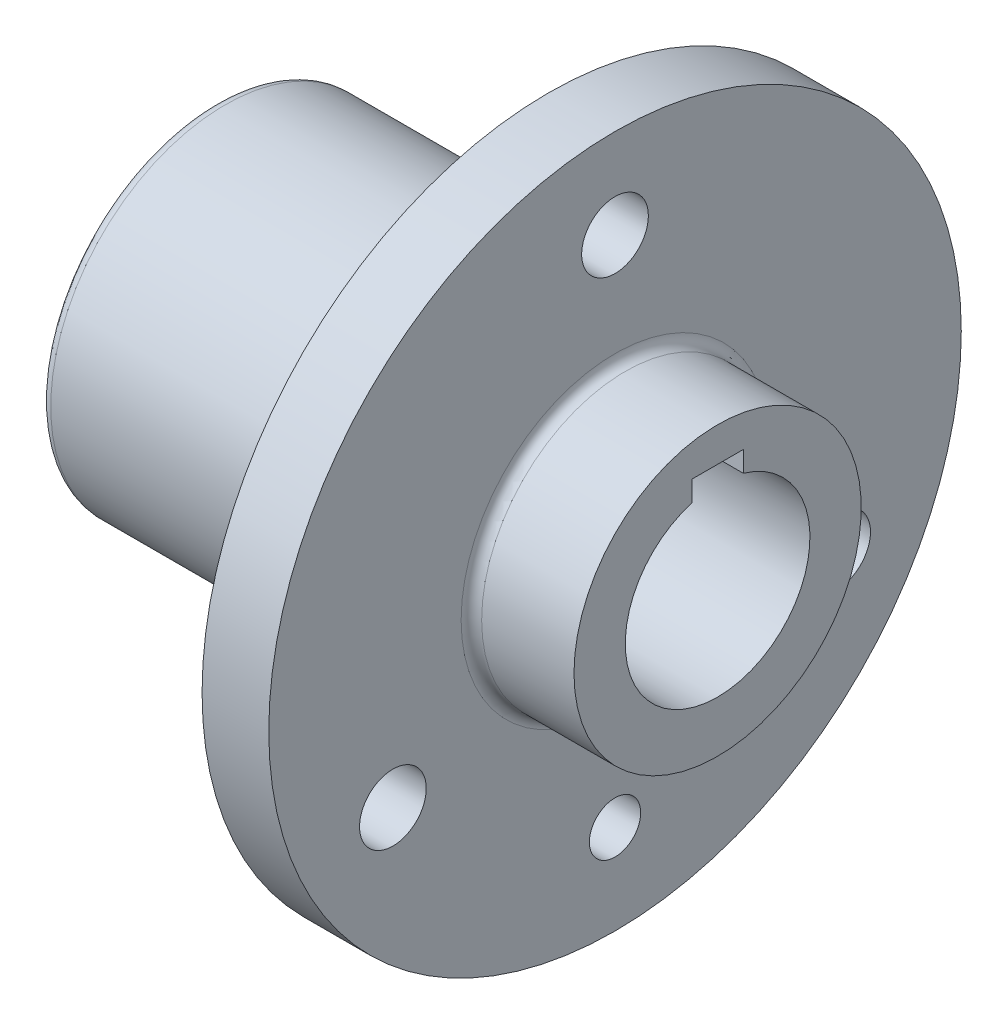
ISO-10303-21;
HEADER;
FILE_DESCRIPTION(('STEP AP214'),'2;1');
FILE_NAME('part.step','',(''),(''),'','','');
FILE_SCHEMA(('AUTOMOTIVE_DESIGN { 1 0 10303 214 1 1 1 1 }'));
ENDSEC;
DATA;
#1=APPLICATION_CONTEXT('core data for automotive mechanical design processes');
#2=APPLICATION_PROTOCOL_DEFINITION('international standard','automotive_design',2000,#1);
#3=PRODUCT_CONTEXT('',#1,'mechanical');
#4=PRODUCT('Part','Part','',(#3));
#5=PRODUCT_RELATED_PRODUCT_CATEGORY('part','',(#4));
#6=PRODUCT_DEFINITION_FORMATION('','',#4);
#7=PRODUCT_DEFINITION_CONTEXT('part definition',#1,'design');
#8=PRODUCT_DEFINITION('design','',#6,#7);
#9=PRODUCT_DEFINITION_SHAPE('','',#8);
#10=(LENGTH_UNIT() NAMED_UNIT(*) SI_UNIT(.MILLI.,.METRE.));
#11=(NAMED_UNIT(*) PLANE_ANGLE_UNIT() SI_UNIT($,.RADIAN.));
#12=(NAMED_UNIT(*) SI_UNIT($,.STERADIAN.) SOLID_ANGLE_UNIT());
#13=UNCERTAINTY_MEASURE_WITH_UNIT(LENGTH_MEASURE(1.E-05),#10,'distance_accuracy_value','');
#14=(GEOMETRIC_REPRESENTATION_CONTEXT(3) GLOBAL_UNCERTAINTY_ASSIGNED_CONTEXT((#13)) GLOBAL_UNIT_ASSIGNED_CONTEXT((#10,
#11,#12)) REPRESENTATION_CONTEXT('',''));
#15=CARTESIAN_POINT('',(0.,0.,0.));
#16=DIRECTION('',(0.,0.,1.));
#17=DIRECTION('',(1.,0.,0.));
#18=AXIS2_PLACEMENT_3D('',#15,#16,#17);
#19=CARTESIAN_POINT('',(-48.7465831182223,-10.,0.));
#20=DIRECTION('',(-1.,0.,0.));
#21=DIRECTION('',(0.,0.,1.));
#22=AXIS2_PLACEMENT_3D('',#19,#20,#21);
#23=CYLINDRICAL_SURFACE('',#22,10.);
#24=CARTESIAN_POINT('',(-36.7465831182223,-10.,0.));
#25=DIRECTION('',(-1.,0.,0.));
#26=DIRECTION('',(0.,0.,1.));
#27=AXIS2_PLACEMENT_3D('',#24,#25,#26);
#28=CIRCLE('',#27,10.);
#29=CARTESIAN_POINT('',(-36.7465831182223,-10.,10.));
#30=VERTEX_POINT('',#29);
#31=EDGE_CURVE('E171',#30,#30,#28,.T.);
#32=ORIENTED_EDGE('',*,*,#31,.F.);
#33=EDGE_LOOP('',(#32));
#34=FACE_BOUND('',#33,.T.);
#35=CARTESIAN_POINT('',(-48.7465831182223,-10.,0.));
#36=DIRECTION('',(-1.,0.,0.));
#37=DIRECTION('',(0.,0.,1.));
#38=AXIS2_PLACEMENT_3D('',#35,#36,#37);
#39=CIRCLE('',#38,10.);
#40=CARTESIAN_POINT('',(-48.7465831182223,-10.,10.));
#41=VERTEX_POINT('',#40);
#42=EDGE_CURVE('E139',#41,#41,#39,.T.);
#43=ORIENTED_EDGE('',*,*,#42,.T.);
#44=EDGE_LOOP('',(#43));
#45=FACE_BOUND('',#44,.T.);
#46=ADVANCED_FACE('F43',(#34,#45),#23,.F.);
#47=CARTESIAN_POINT('',(-36.7465831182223,-10.,0.));
#48=DIRECTION('',(1.,0.,0.));
#49=DIRECTION('',(0.,0.,-1.));
#50=AXIS2_PLACEMENT_3D('',#47,#48,#49);
#51=CONICAL_SURFACE('',#50,10.,0.78539816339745);
#52=CARTESIAN_POINT('',(-33.7465831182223,-10.,0.));
#53=DIRECTION('',(-1.,0.,0.));
#54=DIRECTION('',(0.,0.,1.));
#55=AXIS2_PLACEMENT_3D('',#52,#53,#54);
#56=CIRCLE('',#55,13.);
#57=CARTESIAN_POINT('',(-33.7465831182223,-10.,13.));
#58=VERTEX_POINT('',#57);
#59=EDGE_CURVE('E167',#58,#58,#56,.T.);
#60=ORIENTED_EDGE('',*,*,#59,.F.);
#61=EDGE_LOOP('',(#60));
#62=FACE_BOUND('',#61,.T.);
#63=ORIENTED_EDGE('',*,*,#31,.T.);
#64=EDGE_LOOP('',(#63));
#65=FACE_BOUND('',#64,.T.);
#66=ADVANCED_FACE('F295',(#62,#65),#51,.F.);
#67=CARTESIAN_POINT('',(-33.7465831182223,3.00000000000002,0.));
#68=DIRECTION('',(-1.,0.,0.));
#69=DIRECTION('',(0.,0.,1.));
#70=AXIS2_PLACEMENT_3D('',#67,#68,#69);
#71=PLANE('',#70);
#72=CARTESIAN_POINT('',(-33.7465831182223,-10.,0.));
#73=DIRECTION('',(-1.,0.,0.));
#74=DIRECTION('',(0.,0.,1.));
#75=AXIS2_PLACEMENT_3D('',#72,#73,#74);
#76=CIRCLE('',#75,22.);
#77=CARTESIAN_POINT('',(-33.7465831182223,-10.,22.));
#78=VERTEX_POINT('',#77);
#79=EDGE_CURVE('E217',#78,#78,#76,.F.);
#80=ORIENTED_EDGE('',*,*,#79,.T.);
#81=EDGE_LOOP('',(#80));
#82=FACE_BOUND('',#81,.T.);
#83=ORIENTED_EDGE('',*,*,#59,.T.);
#84=EDGE_LOOP('',(#83));
#85=FACE_BOUND('',#84,.T.);
#86=ADVANCED_FACE('F291',(#82,#85),#71,.F.);
#87=CARTESIAN_POINT('',(-48.7465831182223,-10.,0.));
#88=DIRECTION('',(-1.,0.,0.));
#89=DIRECTION('',(0.,0.,1.));
#90=AXIS2_PLACEMENT_3D('',#87,#88,#89);
#91=CYLINDRICAL_SURFACE('',#90,24.);
#92=CARTESIAN_POINT('',(-31.7465831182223,-10.,0.));
#93=DIRECTION('',(-1.,0.,0.));
#94=DIRECTION('',(0.,0.,1.));
#95=AXIS2_PLACEMENT_3D('',#92,#93,#94);
#96=CIRCLE('',#95,24.);
#97=CARTESIAN_POINT('',(-31.7465831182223,-10.,24.));
#98=VERTEX_POINT('',#97);
#99=EDGE_CURVE('E213',#98,#98,#96,.T.);
#100=ORIENTED_EDGE('',*,*,#99,.T.);
#101=EDGE_LOOP('',(#100));
#102=FACE_BOUND('',#101,.T.);
#103=CARTESIAN_POINT('',(2.25341688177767,-10.,0.));
#104=DIRECTION('',(-1.,0.,0.));
#105=DIRECTION('',(0.,0.,1.));
#106=AXIS2_PLACEMENT_3D('',#103,#104,#105);
#107=CIRCLE('',#106,24.);
#108=CARTESIAN_POINT('',(2.25341688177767,-10.,24.));
#109=VERTEX_POINT('',#108);
#110=EDGE_CURVE('E163',#109,#109,#107,.T.);
#111=ORIENTED_EDGE('',*,*,#110,.F.);
#112=EDGE_LOOP('',(#111));
#113=FACE_BOUND('',#112,.T.);
#114=ADVANCED_FACE('F288',(#102,#113),#91,.F.);
#115=CARTESIAN_POINT('',(2.25341688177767,14.,0.));
#116=DIRECTION('',(1.,0.,0.));
#117=DIRECTION('',(0.,0.,-1.));
#118=AXIS2_PLACEMENT_3D('',#115,#116,#117);
#119=PLANE('',#118);
#120=CARTESIAN_POINT('',(2.25341688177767,-10.,0.));
#121=DIRECTION('',(1.,0.,0.));
#122=DIRECTION('',(0.,0.,-1.));
#123=AXIS2_PLACEMENT_3D('',#120,#121,#122);
#124=CIRCLE('',#123,20.);
#125=CARTESIAN_POINT('',(2.25341688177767,9.36491673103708,5.));
#126=VERTEX_POINT('',#125);
#127=CARTESIAN_POINT('',(2.25341688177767,9.36491673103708,-5.));
#128=VERTEX_POINT('',#127);
#129=EDGE_CURVE('E115',#126,#128,#124,.T.);
#130=ORIENTED_EDGE('',*,*,#129,.T.);
#131=DIRECTION('',(0.,1.,0.));
#132=VECTOR('',#131,1.);
#133=CARTESIAN_POINT('',(2.25341688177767,4.70000000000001,-5.));
#134=LINE('',#133,#132);
#135=CARTESIAN_POINT('',(2.25341688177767,11.3,-5.));
#136=VERTEX_POINT('',#135);
#137=EDGE_CURVE('E93',#128,#136,#134,.T.);
#138=ORIENTED_EDGE('',*,*,#137,.T.);
#139=DIRECTION('',(0.,0.,1.));
#140=VECTOR('',#139,1.);
#141=CARTESIAN_POINT('',(2.25341688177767,11.3,5.));
#142=LINE('',#141,#140);
#143=CARTESIAN_POINT('',(2.25341688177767,11.3,5.));
#144=VERTEX_POINT('',#143);
#145=EDGE_CURVE('E104',#136,#144,#142,.T.);
#146=ORIENTED_EDGE('',*,*,#145,.T.);
#147=DIRECTION('',(0.,-1.,0.));
#148=VECTOR('',#147,1.);
#149=CARTESIAN_POINT('',(2.25341688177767,4.70000000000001,5.));
#150=LINE('',#149,#148);
#151=EDGE_CURVE('E101',#144,#126,#150,.T.);
#152=ORIENTED_EDGE('',*,*,#151,.T.);
#153=EDGE_LOOP('',(#130,#138,#146,#152));
#154=FACE_BOUND('',#153,.T.);
#155=ORIENTED_EDGE('',*,*,#110,.T.);
#156=EDGE_LOOP('',(#155));
#157=FACE_BOUND('',#156,.T.);
#158=ADVANCED_FACE('F112',(#154,#157),#119,.F.);
#159=CARTESIAN_POINT('',(-48.7465831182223,-10.,0.));
#160=DIRECTION('',(-1.,0.,0.));
#161=DIRECTION('',(0.,0.,1.));
#162=AXIS2_PLACEMENT_3D('',#159,#160,#161);
#163=CYLINDRICAL_SURFACE('',#162,18.);
#164=CARTESIAN_POINT('',(54.2534168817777,-10.,0.));
#165=DIRECTION('',(-1.,0.,0.));
#166=DIRECTION('',(0.,0.,1.));
#167=AXIS2_PLACEMENT_3D('',#164,#165,#166);
#168=CIRCLE('',#167,18.);
#169=CARTESIAN_POINT('',(54.2534168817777,7.29161646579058,-5.));
#170=VERTEX_POINT('',#169);
#171=CARTESIAN_POINT('',(54.2534168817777,7.29161646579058,5.));
#172=VERTEX_POINT('',#171);
#173=EDGE_CURVE('E159',#170,#172,#168,.T.);
#174=ORIENTED_EDGE('',*,*,#173,.F.);
#175=DIRECTION('',(-1.,0.,0.));
#176=VECTOR('',#175,1.);
#177=CARTESIAN_POINT('',(-48.7465831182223,7.29161646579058,-5.));
#178=LINE('',#177,#176);
#179=CARTESIAN_POINT('',(4.25341688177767,7.29161646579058,-5.));
#180=VERTEX_POINT('',#179);
#181=EDGE_CURVE('E136',#170,#180,#178,.T.);
#182=ORIENTED_EDGE('',*,*,#181,.T.);
#183=CARTESIAN_POINT('',(4.25341688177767,-10.,0.));
#184=DIRECTION('',(1.,0.,0.));
#185=DIRECTION('',(0.,0.,-1.));
#186=AXIS2_PLACEMENT_3D('',#183,#184,#185);
#187=CIRCLE('',#186,18.);
#188=CARTESIAN_POINT('',(4.25341688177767,7.29161646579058,5.));
#189=VERTEX_POINT('',#188);
#190=EDGE_CURVE('E207',#180,#189,#187,.F.);
#191=ORIENTED_EDGE('',*,*,#190,.T.);
#192=DIRECTION('',(-1.,0.,0.));
#193=VECTOR('',#192,1.);
#194=CARTESIAN_POINT('',(-48.7465831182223,7.29161646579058,5.));
#195=LINE('',#194,#193);
#196=EDGE_CURVE('E61',#189,#172,#195,.F.);
#197=ORIENTED_EDGE('',*,*,#196,.T.);
#198=EDGE_LOOP('',(#174,#182,#191,#197));
#199=FACE_BOUND('',#198,.T.);
#200=ADVANCED_FACE('F281',(#199),#163,.F.);
#201=CARTESIAN_POINT('',(54.2534168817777,8.,0.));
#202=DIRECTION('',(-1.,0.,0.));
#203=DIRECTION('',(0.,0.,1.));
#204=AXIS2_PLACEMENT_3D('',#201,#202,#203);
#205=PLANE('',#204);
#206=CARTESIAN_POINT('',(54.2534168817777,-10.,0.));
#207=DIRECTION('',(-1.,0.,0.));
#208=DIRECTION('',(0.,0.,1.));
#209=AXIS2_PLACEMENT_3D('',#206,#207,#208);
#210=CIRCLE('',#209,28.);
#211=CARTESIAN_POINT('',(54.2534168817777,-10.,28.));
#212=VERTEX_POINT('',#211);
#213=EDGE_CURVE('E155',#212,#212,#210,.T.);
#214=ORIENTED_EDGE('',*,*,#213,.F.);
#215=EDGE_LOOP('',(#214));
#216=FACE_BOUND('',#215,.T.);
#217=DIRECTION('',(0.,0.,1.));
#218=VECTOR('',#217,1.);
#219=CARTESIAN_POINT('',(54.2534168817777,11.3,5.));
#220=LINE('',#219,#218);
#221=CARTESIAN_POINT('',(54.2534168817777,11.3,-5.));
#222=VERTEX_POINT('',#221);
#223=CARTESIAN_POINT('',(54.2534168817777,11.3,5.));
#224=VERTEX_POINT('',#223);
#225=EDGE_CURVE('E120',#222,#224,#220,.T.);
#226=ORIENTED_EDGE('',*,*,#225,.F.);
#227=DIRECTION('',(0.,1.,0.));
#228=VECTOR('',#227,1.);
#229=CARTESIAN_POINT('',(54.2534168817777,4.70000000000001,-5.));
#230=LINE('',#229,#228);
#231=EDGE_CURVE('E95',#170,#222,#230,.T.);
#232=ORIENTED_EDGE('',*,*,#231,.F.);
#233=ORIENTED_EDGE('',*,*,#173,.T.);
#234=DIRECTION('',(0.,-1.,0.));
#235=VECTOR('',#234,1.);
#236=CARTESIAN_POINT('',(54.2534168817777,4.70000000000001,5.));
#237=LINE('',#236,#235);
#238=EDGE_CURVE('E117',#224,#172,#237,.T.);
#239=ORIENTED_EDGE('',*,*,#238,.F.);
#240=EDGE_LOOP('',(#226,#232,#233,#239));
#241=FACE_BOUND('',#240,.T.);
#242=ADVANCED_FACE('F277',(#216,#241),#205,.F.);
#243=CARTESIAN_POINT('',(-48.7465831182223,-10.,0.));
#244=DIRECTION('',(-1.,0.,0.));
#245=DIRECTION('',(0.,0.,1.));
#246=AXIS2_PLACEMENT_3D('',#243,#244,#245);
#247=CYLINDRICAL_SURFACE('',#246,28.);
#248=CARTESIAN_POINT('',(36.2534168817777,-10.,0.));
#249=DIRECTION('',(-1.,0.,0.));
#250=DIRECTION('',(0.,0.,1.));
#251=AXIS2_PLACEMENT_3D('',#248,#249,#250);
#252=CIRCLE('',#251,28.);
#253=CARTESIAN_POINT('',(36.2534168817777,-10.,28.));
#254=VERTEX_POINT('',#253);
#255=EDGE_CURVE('E195',#254,#254,#252,.F.);
#256=ORIENTED_EDGE('',*,*,#255,.T.);
#257=EDGE_LOOP('',(#256));
#258=FACE_BOUND('',#257,.T.);
#259=ORIENTED_EDGE('',*,*,#213,.T.);
#260=EDGE_LOOP('',(#259));
#261=FACE_BOUND('',#260,.T.);
#262=ADVANCED_FACE('F273',(#258,#261),#247,.T.);
#263=CARTESIAN_POINT('',(34.2534168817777,57.5,0.));
#264=DIRECTION('',(-1.,0.,0.));
#265=DIRECTION('',(0.,0.,1.));
#266=AXIS2_PLACEMENT_3D('',#263,#264,#265);
#267=PLANE('',#266);
#268=CARTESIAN_POINT('',(34.2534168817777,40.,0.));
#269=DIRECTION('',(1.,0.,0.));
#270=DIRECTION('',(0.,0.,-1.));
#271=AXIS2_PLACEMENT_3D('',#268,#269,#270);
#272=CIRCLE('',#271,6.5);
#273=CARTESIAN_POINT('',(34.2534168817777,40.,-6.5));
#274=VERTEX_POINT('',#273);
#275=EDGE_CURVE('E582',#274,#274,#272,.T.);
#276=ORIENTED_EDGE('',*,*,#275,.F.);
#277=EDGE_LOOP('',(#276));
#278=FACE_BOUND('',#277,.T.);
#279=CARTESIAN_POINT('',(34.2534168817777,-60.,0.));
#280=DIRECTION('',(1.,0.,0.));
#281=DIRECTION('',(0.,0.,-1.));
#282=AXIS2_PLACEMENT_3D('',#279,#280,#281);
#283=CIRCLE('',#282,5.);
#284=CARTESIAN_POINT('',(34.2534168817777,-60.,-5.));
#285=VERTEX_POINT('',#284);
#286=EDGE_CURVE('E601',#285,#285,#283,.T.);
#287=ORIENTED_EDGE('',*,*,#286,.F.);
#288=EDGE_LOOP('',(#287));
#289=FACE_BOUND('',#288,.T.);
#290=CARTESIAN_POINT('',(34.2534168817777,-34.9999999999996,-43.3012701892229));
#291=DIRECTION('',(1.,0.,0.));
#292=DIRECTION('',(0.,0.,-1.));
#293=AXIS2_PLACEMENT_3D('',#290,#291,#292);
#294=CIRCLE('',#293,6.50000000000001);
#295=CARTESIAN_POINT('',(34.2534168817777,-34.9999999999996,-49.8012701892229));
#296=VERTEX_POINT('',#295);
#297=EDGE_CURVE('E605',#296,#296,#294,.T.);
#298=ORIENTED_EDGE('',*,*,#297,.F.);
#299=EDGE_LOOP('',(#298));
#300=FACE_BOUND('',#299,.T.);
#301=CARTESIAN_POINT('',(34.2534168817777,-35.0000000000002,43.3012701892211));
#302=DIRECTION('',(1.,0.,0.));
#303=DIRECTION('',(0.,0.,-1.));
#304=AXIS2_PLACEMENT_3D('',#301,#302,#303);
#305=CIRCLE('',#304,6.5);
#306=CARTESIAN_POINT('',(34.2534168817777,-35.0000000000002,36.8012701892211));
#307=VERTEX_POINT('',#306);
#308=EDGE_CURVE('E123',#307,#307,#305,.T.);
#309=ORIENTED_EDGE('',*,*,#308,.F.);
#310=EDGE_LOOP('',(#309));
#311=FACE_BOUND('',#310,.T.);
#312=CARTESIAN_POINT('',(34.2534168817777,-10.,0.));
#313=DIRECTION('',(-1.,0.,0.));
#314=DIRECTION('',(0.,0.,1.));
#315=AXIS2_PLACEMENT_3D('',#312,#313,#314);
#316=CIRCLE('',#315,30.);
#317=CARTESIAN_POINT('',(34.2534168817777,-10.,30.));
#318=VERTEX_POINT('',#317);
#319=EDGE_CURVE('E191',#318,#318,#316,.T.);
#320=ORIENTED_EDGE('',*,*,#319,.T.);
#321=EDGE_LOOP('',(#320));
#322=FACE_BOUND('',#321,.T.);
#323=CARTESIAN_POINT('',(34.2534168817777,-10.,0.));
#324=DIRECTION('',(-1.,0.,0.));
#325=DIRECTION('',(0.,0.,1.));
#326=AXIS2_PLACEMENT_3D('',#323,#324,#325);
#327=CIRCLE('',#326,67.5);
#328=CARTESIAN_POINT('',(34.2534168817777,-10.,67.5));
#329=VERTEX_POINT('',#328);
#330=EDGE_CURVE('E151',#329,#329,#327,.T.);
#331=ORIENTED_EDGE('',*,*,#330,.F.);
#332=EDGE_LOOP('',(#331));
#333=FACE_BOUND('',#332,.T.);
#334=ADVANCED_FACE('F269',(#278,#289,#300,#311,#322,#333),#267,.F.);
#335=CARTESIAN_POINT('',(-48.7465831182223,-10.,0.));
#336=DIRECTION('',(-1.,0.,0.));
#337=DIRECTION('',(0.,0.,1.));
#338=AXIS2_PLACEMENT_3D('',#335,#336,#337);
#339=CYLINDRICAL_SURFACE('',#338,67.5);
#340=CARTESIAN_POINT('',(21.2534168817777,-10.,0.));
#341=DIRECTION('',(-1.,0.,0.));
#342=DIRECTION('',(0.,0.,1.));
#343=AXIS2_PLACEMENT_3D('',#340,#341,#342);
#344=CIRCLE('',#343,67.5);
#345=CARTESIAN_POINT('',(21.2534168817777,-10.,67.5));
#346=VERTEX_POINT('',#345);
#347=EDGE_CURVE('E147',#346,#346,#344,.T.);
#348=ORIENTED_EDGE('',*,*,#347,.F.);
#349=EDGE_LOOP('',(#348));
#350=FACE_BOUND('',#349,.T.);
#351=ORIENTED_EDGE('',*,*,#330,.T.);
#352=EDGE_LOOP('',(#351));
#353=FACE_BOUND('',#352,.T.);
#354=ADVANCED_FACE('F265',(#350,#353),#339,.T.);
#355=CARTESIAN_POINT('',(21.2534168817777,24.,0.));
#356=DIRECTION('',(1.,0.,0.));
#357=DIRECTION('',(0.,0.,-1.));
#358=AXIS2_PLACEMENT_3D('',#355,#356,#357);
#359=PLANE('',#358);
#360=CARTESIAN_POINT('',(21.2534168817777,40.,0.));
#361=DIRECTION('',(1.,0.,0.));
#362=DIRECTION('',(0.,0.,-1.));
#363=AXIS2_PLACEMENT_3D('',#360,#361,#362);
#364=CIRCLE('',#363,6.5);
#365=CARTESIAN_POINT('',(21.2534168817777,40.,-6.5));
#366=VERTEX_POINT('',#365);
#367=EDGE_CURVE('E47',#366,#366,#364,.T.);
#368=ORIENTED_EDGE('',*,*,#367,.T.);
#369=EDGE_LOOP('',(#368));
#370=FACE_BOUND('',#369,.T.);
#371=CARTESIAN_POINT('',(21.2534168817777,-60.,0.));
#372=DIRECTION('',(1.,0.,0.));
#373=DIRECTION('',(0.,0.,-1.));
#374=AXIS2_PLACEMENT_3D('',#371,#372,#373);
#375=CIRCLE('',#374,5.);
#376=CARTESIAN_POINT('',(21.2534168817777,-60.,-5.));
#377=VERTEX_POINT('',#376);
#378=EDGE_CURVE('E586',#377,#377,#375,.T.);
#379=ORIENTED_EDGE('',*,*,#378,.T.);
#380=EDGE_LOOP('',(#379));
#381=FACE_BOUND('',#380,.T.);
#382=CARTESIAN_POINT('',(21.2534168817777,-34.9999999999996,-43.3012701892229));
#383=DIRECTION('',(1.,0.,0.));
#384=DIRECTION('',(0.,0.,-1.));
#385=AXIS2_PLACEMENT_3D('',#382,#383,#384);
#386=CIRCLE('',#385,6.50000000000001);
#387=CARTESIAN_POINT('',(21.2534168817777,-34.9999999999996,-49.8012701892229));
#388=VERTEX_POINT('',#387);
#389=EDGE_CURVE('E589',#388,#388,#386,.T.);
#390=ORIENTED_EDGE('',*,*,#389,.T.);
#391=EDGE_LOOP('',(#390));
#392=FACE_BOUND('',#391,.T.);
#393=CARTESIAN_POINT('',(21.2534168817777,-35.0000000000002,43.3012701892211));
#394=DIRECTION('',(1.,0.,0.));
#395=DIRECTION('',(0.,0.,-1.));
#396=AXIS2_PLACEMENT_3D('',#393,#394,#395);
#397=CIRCLE('',#396,6.5);
#398=CARTESIAN_POINT('',(21.2534168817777,-35.0000000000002,36.8012701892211));
#399=VERTEX_POINT('',#398);
#400=EDGE_CURVE('E594',#399,#399,#397,.T.);
#401=ORIENTED_EDGE('',*,*,#400,.T.);
#402=EDGE_LOOP('',(#401));
#403=FACE_BOUND('',#402,.T.);
#404=CARTESIAN_POINT('',(21.2534168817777,-10.,0.));
#405=DIRECTION('',(1.,0.,0.));
#406=DIRECTION('',(0.,0.,-1.));
#407=AXIS2_PLACEMENT_3D('',#404,#405,#406);
#408=CIRCLE('',#407,36.);
#409=CARTESIAN_POINT('',(21.2534168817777,-10.,-36.));
#410=VERTEX_POINT('',#409);
#411=EDGE_CURVE('E199',#410,#410,#408,.T.);
#412=ORIENTED_EDGE('',*,*,#411,.T.);
#413=EDGE_LOOP('',(#412));
#414=FACE_BOUND('',#413,.T.);
#415=ORIENTED_EDGE('',*,*,#347,.T.);
#416=EDGE_LOOP('',(#415));
#417=FACE_BOUND('',#416,.T.);
#418=ADVANCED_FACE('F261',(#370,#381,#392,#403,#414,#417),#359,.F.);
#419=CARTESIAN_POINT('',(-48.7465831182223,-10.,0.));
#420=DIRECTION('',(-1.,0.,0.));
#421=DIRECTION('',(0.,0.,1.));
#422=AXIS2_PLACEMENT_3D('',#419,#420,#421);
#423=CYLINDRICAL_SURFACE('',#422,34.);
#424=CARTESIAN_POINT('',(-41.7465831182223,-10.,0.));
#425=DIRECTION('',(1.,0.,0.));
#426=DIRECTION('',(0.,0.,-1.));
#427=AXIS2_PLACEMENT_3D('',#424,#425,#426);
#428=CIRCLE('',#427,34.);
#429=CARTESIAN_POINT('',(-41.7465831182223,-10.,-34.));
#430=VERTEX_POINT('',#429);
#431=EDGE_CURVE('E187',#430,#430,#428,.T.);
#432=ORIENTED_EDGE('',*,*,#431,.T.);
#433=EDGE_LOOP('',(#432));
#434=FACE_BOUND('',#433,.T.);
#435=CARTESIAN_POINT('',(19.2534168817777,-10.,0.));
#436=DIRECTION('',(1.,0.,0.));
#437=DIRECTION('',(0.,0.,-1.));
#438=AXIS2_PLACEMENT_3D('',#435,#436,#437);
#439=CIRCLE('',#438,34.);
#440=CARTESIAN_POINT('',(19.2534168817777,-10.,-34.));
#441=VERTEX_POINT('',#440);
#442=EDGE_CURVE('E183',#441,#441,#439,.F.);
#443=ORIENTED_EDGE('',*,*,#442,.T.);
#444=EDGE_LOOP('',(#443));
#445=FACE_BOUND('',#444,.T.);
#446=ADVANCED_FACE('F257',(#434,#445),#423,.T.);
#447=CARTESIAN_POINT('',(-43.7465831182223,5.,0.));
#448=DIRECTION('',(1.,0.,0.));
#449=DIRECTION('',(0.,0.,-1.));
#450=AXIS2_PLACEMENT_3D('',#447,#448,#449);
#451=PLANE('',#450);
#452=CARTESIAN_POINT('',(-43.7465831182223,-10.,0.));
#453=DIRECTION('',(1.,0.,0.));
#454=DIRECTION('',(0.,0.,-1.));
#455=AXIS2_PLACEMENT_3D('',#452,#453,#454);
#456=CIRCLE('',#455,32.);
#457=CARTESIAN_POINT('',(-43.7465831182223,-10.,-32.));
#458=VERTEX_POINT('',#457);
#459=EDGE_CURVE('E179',#458,#458,#456,.F.);
#460=ORIENTED_EDGE('',*,*,#459,.T.);
#461=EDGE_LOOP('',(#460));
#462=FACE_BOUND('',#461,.T.);
#463=CARTESIAN_POINT('',(-43.7465831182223,-10.,0.));
#464=DIRECTION('',(1.,0.,0.));
#465=DIRECTION('',(0.,0.,-1.));
#466=AXIS2_PLACEMENT_3D('',#463,#464,#465);
#467=CIRCLE('',#466,17.);
#468=CARTESIAN_POINT('',(-43.7465831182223,-10.,-17.));
#469=VERTEX_POINT('',#468);
#470=EDGE_CURVE('E175',#469,#469,#467,.T.);
#471=ORIENTED_EDGE('',*,*,#470,.T.);
#472=EDGE_LOOP('',(#471));
#473=FACE_BOUND('',#472,.T.);
#474=ADVANCED_FACE('F253',(#462,#473),#451,.F.);
#475=CARTESIAN_POINT('',(-48.7465831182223,-10.,0.));
#476=DIRECTION('',(-1.,0.,0.));
#477=DIRECTION('',(0.,0.,1.));
#478=AXIS2_PLACEMENT_3D('',#475,#476,#477);
#479=CYLINDRICAL_SURFACE('',#478,15.);
#480=CARTESIAN_POINT('',(-45.7465831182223,-10.,0.));
#481=DIRECTION('',(1.,0.,0.));
#482=DIRECTION('',(0.,0.,-1.));
#483=AXIS2_PLACEMENT_3D('',#480,#481,#482);
#484=CIRCLE('',#483,15.);
#485=CARTESIAN_POINT('',(-45.7465831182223,-10.,-15.));
#486=VERTEX_POINT('',#485);
#487=EDGE_CURVE('E203',#486,#486,#484,.F.);
#488=ORIENTED_EDGE('',*,*,#487,.T.);
#489=EDGE_LOOP('',(#488));
#490=FACE_BOUND('',#489,.T.);
#491=CARTESIAN_POINT('',(-48.7465831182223,-10.,0.));
#492=DIRECTION('',(-1.,0.,0.));
#493=DIRECTION('',(0.,0.,1.));
#494=AXIS2_PLACEMENT_3D('',#491,#492,#493);
#495=CIRCLE('',#494,15.);
#496=CARTESIAN_POINT('',(-48.7465831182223,-10.,15.));
#497=VERTEX_POINT('',#496);
#498=EDGE_CURVE('E143',#497,#497,#495,.T.);
#499=ORIENTED_EDGE('',*,*,#498,.F.);
#500=EDGE_LOOP('',(#499));
#501=FACE_BOUND('',#500,.T.);
#502=ADVANCED_FACE('F249',(#490,#501),#479,.T.);
#503=CARTESIAN_POINT('',(-48.7465831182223,0.,0.));
#504=DIRECTION('',(1.,0.,0.));
#505=DIRECTION('',(0.,0.,-1.));
#506=AXIS2_PLACEMENT_3D('',#503,#504,#505);
#507=PLANE('',#506);
#508=ORIENTED_EDGE('',*,*,#42,.F.);
#509=EDGE_LOOP('',(#508));
#510=FACE_BOUND('',#509,.T.);
#511=ORIENTED_EDGE('',*,*,#498,.T.);
#512=EDGE_LOOP('',(#511));
#513=FACE_BOUND('',#512,.T.);
#514=ADVANCED_FACE('F245',(#510,#513),#507,.F.);
#515=CARTESIAN_POINT('',(-41.7465831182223,-10.,0.));
#516=DIRECTION('',(1.,0.,0.));
#517=DIRECTION('',(0.,0.,-1.));
#518=AXIS2_PLACEMENT_3D('',#515,#516,#517);
#519=TOROIDAL_SURFACE('',#518,32.,2.);
#520=ORIENTED_EDGE('',*,*,#431,.F.);
#521=EDGE_LOOP('',(#520));
#522=FACE_BOUND('',#521,.T.);
#523=ORIENTED_EDGE('',*,*,#459,.F.);
#524=EDGE_LOOP('',(#523));
#525=FACE_BOUND('',#524,.T.);
#526=ADVANCED_FACE('F248',(#522,#525),#519,.T.);
#527=CARTESIAN_POINT('',(36.2534168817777,-10.,0.));
#528=DIRECTION('',(-1.,0.,0.));
#529=DIRECTION('',(0.,0.,1.));
#530=AXIS2_PLACEMENT_3D('',#527,#528,#529);
#531=TOROIDAL_SURFACE('',#530,30.,2.);
#532=ORIENTED_EDGE('',*,*,#255,.F.);
#533=EDGE_LOOP('',(#532));
#534=FACE_BOUND('',#533,.T.);
#535=ORIENTED_EDGE('',*,*,#319,.F.);
#536=EDGE_LOOP('',(#535));
#537=FACE_BOUND('',#536,.T.);
#538=ADVANCED_FACE('F305',(#534,#537),#531,.F.);
#539=CARTESIAN_POINT('',(19.2534168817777,-10.,0.));
#540=DIRECTION('',(1.,0.,0.));
#541=DIRECTION('',(0.,0.,-1.));
#542=AXIS2_PLACEMENT_3D('',#539,#540,#541);
#543=TOROIDAL_SURFACE('',#542,36.,2.);
#544=ORIENTED_EDGE('',*,*,#411,.F.);
#545=EDGE_LOOP('',(#544));
#546=FACE_BOUND('',#545,.T.);
#547=ORIENTED_EDGE('',*,*,#442,.F.);
#548=EDGE_LOOP('',(#547));
#549=FACE_BOUND('',#548,.T.);
#550=ADVANCED_FACE('F309',(#546,#549),#543,.F.);
#551=CARTESIAN_POINT('',(-45.7465831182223,-10.,0.));
#552=DIRECTION('',(1.,0.,0.));
#553=DIRECTION('',(0.,0.,-1.));
#554=AXIS2_PLACEMENT_3D('',#551,#552,#553);
#555=TOROIDAL_SURFACE('',#554,17.,2.);
#556=ORIENTED_EDGE('',*,*,#470,.F.);
#557=EDGE_LOOP('',(#556));
#558=FACE_BOUND('',#557,.T.);
#559=ORIENTED_EDGE('',*,*,#487,.F.);
#560=EDGE_LOOP('',(#559));
#561=FACE_BOUND('',#560,.T.);
#562=ADVANCED_FACE('F312',(#558,#561),#555,.F.);
#563=CARTESIAN_POINT('',(4.25341688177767,-10.,0.));
#564=DIRECTION('',(1.,0.,0.));
#565=DIRECTION('',(0.,0.,-1.));
#566=AXIS2_PLACEMENT_3D('',#563,#564,#565);
#567=TOROIDAL_SURFACE('',#566,20.,2.);
#568=CARTESIAN_POINT('',(3.88261377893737,7.32770837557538,-5.));
#569=CARTESIAN_POINT('',(3.98892885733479,7.30683653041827,-5.));
#570=CARTESIAN_POINT('',(4.09707840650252,7.29492524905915,-5.));
#571=CARTESIAN_POINT('',(4.31391484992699,7.28950306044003,-5.));
#572=CARTESIAN_POINT('',(4.42260218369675,7.29601116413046,-5.));
#573=CARTESIAN_POINT('',(4.63725609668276,7.32720765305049,-5.));
#574=CARTESIAN_POINT('',(4.74322462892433,7.35188258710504,-5.));
#575=CARTESIAN_POINT('',(4.94954076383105,7.41852660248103,-5.));
#576=CARTESIAN_POINT('',(5.04988923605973,7.46049299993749,-5.));
#577=CARTESIAN_POINT('',(5.24313328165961,7.56073334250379,-5.));
#578=CARTESIAN_POINT('',(5.33595962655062,7.61914053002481,-5.));
#579=CARTESIAN_POINT('',(5.51088483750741,7.75025745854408,-5.));
#580=CARTESIAN_POINT('',(5.59298199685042,7.82296947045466,-5.));
#581=CARTESIAN_POINT('',(5.74693494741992,7.98306935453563,-5.));
#582=CARTESIAN_POINT('',(5.81838103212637,8.07085104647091,-5.));
#583=CARTESIAN_POINT('',(5.94613185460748,8.25681273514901,-5.));
#584=CARTESIAN_POINT('',(6.00243381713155,8.35499463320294,-5.));
#585=CARTESIAN_POINT('',(6.10036809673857,8.56275029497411,-5.));
#586=CARTESIAN_POINT('',(6.14140222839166,8.67260625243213,-5.));
#587=CARTESIAN_POINT('',(6.20491708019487,8.89755961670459,-5.));
#588=CARTESIAN_POINT('',(6.22739518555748,9.01265775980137,-5.));
#589=CARTESIAN_POINT('',(6.25354226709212,9.24766265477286,-5.));
#590=CARTESIAN_POINT('',(6.25676683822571,9.36761912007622,-5.));
#591=CARTESIAN_POINT('',(6.2430714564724,9.60638459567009,-5.));
#592=CARTESIAN_POINT('',(6.22615064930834,9.72519355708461,-5.));
#593=CARTESIAN_POINT('',(6.17245134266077,9.95842900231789,-5.));
#594=CARTESIAN_POINT('',(6.13564425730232,10.0728489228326,-5.));
#595=CARTESIAN_POINT('',(6.04299601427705,10.2937137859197,-5.));
#596=CARTESIAN_POINT('',(5.98715634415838,10.4001593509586,-5.));
#597=CARTESIAN_POINT('',(5.85902420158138,10.5999394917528,-5.));
#598=CARTESIAN_POINT('',(5.78704686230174,10.693476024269,-5.));
#599=CARTESIAN_POINT('',(5.62800000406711,10.8667000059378,-5.));
#600=CARTESIAN_POINT('',(5.54093281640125,10.9463895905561,-5.));
#601=CARTESIAN_POINT('',(5.35676894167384,11.0872895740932,-5.));
#602=CARTESIAN_POINT('',(5.2600176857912,11.1489514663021,-5.));
#603=CARTESIAN_POINT('',(5.0573254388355,11.2546566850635,-5.));
#604=CARTESIAN_POINT('',(4.95138589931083,11.2987027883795,-5.));
#605=CARTESIAN_POINT('',(4.73625872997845,11.3667969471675,-5.));
#606=CARTESIAN_POINT('',(4.62722417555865,11.391329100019,-5.));
#607=CARTESIAN_POINT('',(4.40657138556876,11.4214408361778,-5.));
#608=CARTESIAN_POINT('',(4.29495341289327,11.4270223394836,-5.));
#609=CARTESIAN_POINT('',(4.07401944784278,11.4191082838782,-5.));
#610=CARTESIAN_POINT('',(3.96469349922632,11.4058872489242,-5.));
#611=CARTESIAN_POINT('',(3.74981476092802,11.3612918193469,-5.));
#612=CARTESIAN_POINT('',(3.64426189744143,11.3299177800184,-5.));
#613=CARTESIAN_POINT('',(3.43976581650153,11.2499776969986,-5.));
#614=CARTESIAN_POINT('',(3.34082942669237,11.2013942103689,-5.));
#615=CARTESIAN_POINT('',(3.15234801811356,11.0885535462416,-5.));
#616=CARTESIAN_POINT('',(3.06280356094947,11.0242954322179,-5.));
#617=CARTESIAN_POINT('',(2.89408811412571,10.8809045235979,-5.));
#618=CARTESIAN_POINT('',(2.81510323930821,10.8015528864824,-5.));
#619=CARTESIAN_POINT('',(2.6711754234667,10.6310072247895,-5.));
#620=CARTESIAN_POINT('',(2.60623411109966,10.5398118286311,-5.));
#621=CARTESIAN_POINT('',(2.49044801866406,10.3456861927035,-5.));
#622=CARTESIAN_POINT('',(2.44000705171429,10.2425151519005,-5.));
#623=CARTESIAN_POINT('',(2.35664158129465,10.0293259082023,-5.));
#624=CARTESIAN_POINT('',(2.32371961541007,9.9193067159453,-5.));
#625=CARTESIAN_POINT('',(2.27543308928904,9.69235612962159,-5.));
#626=CARTESIAN_POINT('',(2.26056875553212,9.57531820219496,-5.));
#627=CARTESIAN_POINT('',(2.25031697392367,9.34038872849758,-5.));
#628=CARTESIAN_POINT('',(2.2549319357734,9.22249707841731,-5.));
#629=CARTESIAN_POINT('',(2.28373532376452,8.98695227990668,-5.));
#630=CARTESIAN_POINT('',(2.30827667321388,8.86934210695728,-5.));
#631=CARTESIAN_POINT('',(2.37676166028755,8.63990653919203,-5.));
#632=CARTESIAN_POINT('',(2.42070541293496,8.52808117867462,-5.));
#633=CARTESIAN_POINT('',(2.5268718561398,8.31358385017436,-5.));
#634=CARTESIAN_POINT('',(2.58907796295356,8.21090368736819,-5.));
#635=CARTESIAN_POINT('',(2.7302500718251,8.01773501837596,-5.));
#636=CARTESIAN_POINT('',(2.80921863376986,7.92724837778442,-5.));
#637=CARTESIAN_POINT('',(2.97981956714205,7.76339735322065,-5.));
#638=CARTESIAN_POINT('',(3.07112240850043,7.68968982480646,-5.));
#639=CARTESIAN_POINT('',(3.26513061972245,7.5594339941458,-5.));
#640=CARTESIAN_POINT('',(3.36781848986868,7.50285984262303,-5.));
#641=CARTESIAN_POINT('',(3.540023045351,7.42711865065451,-5.));
#642=CARTESIAN_POINT('',(3.60696392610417,7.40195276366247,-5.));
#643=CARTESIAN_POINT('',(3.74320863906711,7.35912888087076,-5.));
#644=CARTESIAN_POINT('',(3.81251241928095,7.34147071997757,-5.));
#645=CARTESIAN_POINT('',(3.88261377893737,7.32770837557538,-5.));
#646=B_SPLINE_CURVE_WITH_KNOTS('',3,(#568,#569,#570,#571,#572,#573,#574,#575,#576,#577,#578,
#579,#580,#581,#582,#583,#584,#585,#586,#587,#588,#589,#590,#591,#592,#593,#594,#595,#596,#597,
#598,#599,#600,#601,#602,#603,#604,#605,#606,#607,#608,#609,#610,#611,#612,#613,#614,#615,#616,
#617,#618,#619,#620,#621,#622,#623,#624,#625,#626,#627,#628,#629,#630,#631,#632,#633,#634,#635,
#636,#637,#638,#639,#640,#641,#642,#643,#644,#645),.UNSPECIFIED.,.T.,.F.,(4,2,2,2,2,2,2,2,2,2,2,
2,2,2,2,2,2,2,2,2,2,2,2,2,2,2,2,2,2,2,2,2,2,2,2,2,2,2,4),(0.,0.324772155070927,0.64987963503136,
0.974746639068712,1.29956323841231,1.62709206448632,1.95467292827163,2.29269227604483,
2.63077352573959,2.98097350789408,3.33122282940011,3.68952619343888,4.04784475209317,
4.40667975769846,4.7654867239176,5.11781785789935,5.4700946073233,5.81259412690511,
6.15503963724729,6.48869898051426,6.82232451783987,7.15112871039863,7.47992646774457,
7.80905844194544,8.13821008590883,8.47255883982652,8.80694634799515,9.14990150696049,
9.49290632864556,9.8452108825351,10.1975590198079,10.5562874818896,10.9150180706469,
11.2734239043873,11.6318845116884,11.9821778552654,12.3319400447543,12.5460909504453,
12.7602371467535),.UNSPECIFIED.);
#647=EDGE_CURVE('E11',#128,#180,#646,.T.);
#648=ORIENTED_EDGE('',*,*,#647,.F.);
#649=ORIENTED_EDGE('',*,*,#129,.F.);
#650=CARTESIAN_POINT('',(3.88261377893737,7.32770837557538,5.));
#651=CARTESIAN_POINT('',(3.77390590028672,7.3490614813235,5.));
#652=CARTESIAN_POINT('',(3.66695142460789,7.37981743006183,5.));
#653=CARTESIAN_POINT('',(3.45971934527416,7.45905573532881,5.));
#654=CARTESIAN_POINT('',(3.35945158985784,7.50756358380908,5.));
#655=CARTESIAN_POINT('',(3.16860291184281,7.62053154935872,5.));
#656=CARTESIAN_POINT('',(3.07800454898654,7.68496222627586,5.));
#657=CARTESIAN_POINT('',(2.90860561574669,7.82774737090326,5.));
#658=CARTESIAN_POINT('',(2.82980269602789,7.90609905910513,5.));
#659=CARTESIAN_POINT('',(2.68401282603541,8.07653549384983,5.));
#660=CARTESIAN_POINT('',(2.6173693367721,8.16891385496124,5.));
#661=CARTESIAN_POINT('',(2.49991763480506,8.36324418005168,5.));
#662=CARTESIAN_POINT('',(2.44911276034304,8.46519815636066,5.));
#663=CARTESIAN_POINT('',(2.36300259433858,8.67959492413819,5.));
#664=CARTESIAN_POINT('',(2.32829795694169,8.79227921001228,5.));
#665=CARTESIAN_POINT('',(2.27789001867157,9.02182500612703,5.));
#666=CARTESIAN_POINT('',(2.26218920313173,9.13868706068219,5.));
#667=CARTESIAN_POINT('',(2.2500853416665,9.37569860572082,5.));
#668=CARTESIAN_POINT('',(2.25406377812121,9.49586781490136,5.));
#669=CARTESIAN_POINT('',(2.28218266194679,9.73383183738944,5.));
#670=CARTESIAN_POINT('',(2.3063234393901,9.85162661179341,5.));
#671=CARTESIAN_POINT('',(2.37417397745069,10.0811322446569,5.));
#672=CARTESIAN_POINT('',(2.41783489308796,10.1928575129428,5.));
#673=CARTESIAN_POINT('',(2.52367940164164,10.4071696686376,5.));
#674=CARTESIAN_POINT('',(2.58586124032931,10.5097574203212,5.));
#675=CARTESIAN_POINT('',(2.72567288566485,10.7005630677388,5.));
#676=CARTESIAN_POINT('',(2.80295732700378,10.7890338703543,5.));
#677=CARTESIAN_POINT('',(2.97166932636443,10.9512755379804,5.));
#678=CARTESIAN_POINT('',(3.06309460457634,11.0250487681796,5.));
#679=CARTESIAN_POINT('',(3.25471790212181,11.1535874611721,5.));
#680=CARTESIAN_POINT('',(3.35459559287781,11.2088305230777,5.));
#681=CARTESIAN_POINT('',(3.56237558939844,11.3012835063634,5.));
#682=CARTESIAN_POINT('',(3.67027668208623,11.3384961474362,5.));
#683=CARTESIAN_POINT('',(3.88822486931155,11.39296009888,5.));
#684=CARTESIAN_POINT('',(3.99815688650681,11.4106725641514,5.));
#685=CARTESIAN_POINT('',(4.21942850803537,11.4271447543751,5.));
#686=CARTESIAN_POINT('',(4.3307679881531,11.4259061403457,5.));
#687=CARTESIAN_POINT('',(4.55029939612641,11.4046481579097,5.));
#688=CARTESIAN_POINT('',(4.65851298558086,11.3848514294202,5.));
#689=CARTESIAN_POINT('',(4.87009826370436,11.3274368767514,5.));
#690=CARTESIAN_POINT('',(4.9734699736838,11.2898191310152,5.));
#691=CARTESIAN_POINT('',(5.17291091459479,11.1977736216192,5.));
#692=CARTESIAN_POINT('',(5.26895052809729,11.1432817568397,5.));
#693=CARTESIAN_POINT('',(5.45072935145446,11.0192178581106,5.));
#694=CARTESIAN_POINT('',(5.53646782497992,10.9496447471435,5.));
#695=CARTESIAN_POINT('',(5.69690685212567,10.7961037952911,5.));
#696=CARTESIAN_POINT('',(5.77138063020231,10.7118991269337,5.));
#697=CARTESIAN_POINT('',(5.90557033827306,10.5324602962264,5.));
#698=CARTESIAN_POINT('',(5.96528442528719,10.4372247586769,5.));
#699=CARTESIAN_POINT('',(6.06995606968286,10.2357321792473,5.));
#700=CARTESIAN_POINT('',(6.11447908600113,10.1292494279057,5.));
#701=CARTESIAN_POINT('',(6.18553340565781,9.9104432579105,5.));
#702=CARTESIAN_POINT('',(6.21206216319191,9.79811901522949,5.));
#703=CARTESIAN_POINT('',(6.24704603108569,9.56766163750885,5.));
#704=CARTESIAN_POINT('',(6.25500740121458,9.44945342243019,5.));
#705=CARTESIAN_POINT('',(6.25129970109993,9.21333999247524,5.));
#706=CARTESIAN_POINT('',(6.23962834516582,9.09543481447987,5.));
#707=CARTESIAN_POINT('',(6.19664585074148,8.86137836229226,5.));
#708=CARTESIAN_POINT('',(6.16503617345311,8.74528174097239,5.));
#709=CARTESIAN_POINT('',(6.08268814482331,8.52007050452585,5.));
#710=CARTESIAN_POINT('',(6.03194938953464,8.41095603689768,5.));
#711=CARTESIAN_POINT('',(5.91288198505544,8.20347290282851,5.));
#712=CARTESIAN_POINT('',(5.84463949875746,8.10505486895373,5.));
#713=CARTESIAN_POINT('',(5.69218219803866,7.92147425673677,5.));
#714=CARTESIAN_POINT('',(5.60797012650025,7.83630940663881,5.));
#715=CARTESIAN_POINT('',(5.42831470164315,7.6842000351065,5.));
#716=CARTESIAN_POINT('',(5.33323452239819,7.61682691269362,5.));
#717=CARTESIAN_POINT('',(5.13273006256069,7.49971553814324,5.));
#718=CARTESIAN_POINT('',(5.02730550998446,7.4499777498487,5.));
#719=CARTESIAN_POINT('',(4.81334927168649,7.37150493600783,5.));
#720=CARTESIAN_POINT('',(4.70507713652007,7.34206048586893,5.));
#721=CARTESIAN_POINT('',(4.48517108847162,7.30239200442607,5.));
#722=CARTESIAN_POINT('',(4.37354249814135,7.292139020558,5.));
#723=CARTESIAN_POINT('',(4.1983330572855,7.29134831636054,5.));
#724=CARTESIAN_POINT('',(4.13471427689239,7.29423279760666,5.));
#725=CARTESIAN_POINT('',(4.00807543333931,7.30628032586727,5.));
#726=CARTESIAN_POINT('',(3.94505535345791,7.31544319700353,5.));
#727=CARTESIAN_POINT('',(3.88261377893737,7.32770837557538,5.));
#728=B_SPLINE_CURVE_WITH_KNOTS('',3,(#650,#651,#652,#653,#654,#655,#656,#657,#658,#659,#660,
#661,#662,#663,#664,#665,#666,#667,#668,#669,#670,#671,#672,#673,#674,#675,#676,#677,#678,#679,
#680,#681,#682,#683,#684,#685,#686,#687,#688,#689,#690,#691,#692,#693,#694,#695,#696,#697,#698,
#699,#700,#701,#702,#703,#704,#705,#706,#707,#708,#709,#710,#711,#712,#713,#714,#715,#716,#717,
#718,#719,#720,#721,#722,#723,#724,#725,#726,#727),.UNSPECIFIED.,.T.,.F.,(4,2,2,2,2,2,2,2,2,2,2,
2,2,2,2,2,2,2,2,2,2,2,2,2,2,2,2,2,2,2,2,2,2,2,2,2,2,2,4),(0.,0.33211423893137,0.66470728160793,
0.996689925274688,1.32860635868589,1.66879562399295,2.00905654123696,2.36115392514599,
2.71329735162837,3.07229352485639,3.43129557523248,3.78940428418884,4.1474790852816,
4.49816264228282,4.8487897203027,5.1895232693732,5.53020540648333,5.86264521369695,
6.19505588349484,6.52352900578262,6.85200068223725,7.18173578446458,7.51149444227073,
7.84719607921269,8.18293961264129,8.52760954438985,8.87232822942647,9.22611396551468,
9.57994089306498,9.9391957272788,10.2984581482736,10.6559849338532,11.013450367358,
11.3612973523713,11.709153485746,12.0441306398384,12.3786020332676,12.5693730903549,
12.7601388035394),.UNSPECIFIED.);
#729=EDGE_CURVE('E53',#189,#126,#728,.T.);
#730=ORIENTED_EDGE('',*,*,#729,.F.);
#731=ORIENTED_EDGE('',*,*,#190,.F.);
#732=EDGE_LOOP('',(#648,#649,#730,#731));
#733=FACE_BOUND('',#732,.T.);
#734=ADVANCED_FACE('F231',(#733),#567,.T.);
#735=CARTESIAN_POINT('',(-31.7465831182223,-10.,0.));
#736=DIRECTION('',(-1.,0.,0.));
#737=DIRECTION('',(0.,0.,1.));
#738=AXIS2_PLACEMENT_3D('',#735,#736,#737);
#739=TOROIDAL_SURFACE('',#738,22.,2.);
#740=ORIENTED_EDGE('',*,*,#79,.F.);
#741=EDGE_LOOP('',(#740));
#742=FACE_BOUND('',#741,.T.);
#743=ORIENTED_EDGE('',*,*,#99,.F.);
#744=EDGE_LOOP('',(#743));
#745=FACE_BOUND('',#744,.T.);
#746=ADVANCED_FACE('F45',(#742,#745),#739,.F.);
#747=CARTESIAN_POINT('',(2.25341688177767,4.70000000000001,-5.));
#748=DIRECTION('',(0.,0.,-1.));
#749=DIRECTION('',(-1.,0.,0.));
#750=AXIS2_PLACEMENT_3D('',#747,#748,#749);
#751=PLANE('',#750);
#752=ORIENTED_EDGE('',*,*,#231,.T.);
#753=DIRECTION('',(1.,0.,0.));
#754=VECTOR('',#753,1.);
#755=CARTESIAN_POINT('',(2.25341688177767,11.3,-5.));
#756=LINE('',#755,#754);
#757=EDGE_CURVE('E89',#136,#222,#756,.T.);
#758=ORIENTED_EDGE('',*,*,#757,.F.);
#759=ORIENTED_EDGE('',*,*,#137,.F.);
#760=ORIENTED_EDGE('',*,*,#647,.T.);
#761=ORIENTED_EDGE('',*,*,#181,.F.);
#762=EDGE_LOOP('',(#752,#758,#759,#760,#761));
#763=FACE_BOUND('',#762,.T.);
#764=ADVANCED_FACE('F91',(#763),#751,.F.);
#765=CARTESIAN_POINT('',(2.25341688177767,4.70000000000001,5.));
#766=DIRECTION('',(0.,0.,1.));
#767=DIRECTION('',(1.,0.,0.));
#768=AXIS2_PLACEMENT_3D('',#765,#766,#767);
#769=PLANE('',#768);
#770=ORIENTED_EDGE('',*,*,#729,.T.);
#771=ORIENTED_EDGE('',*,*,#151,.F.);
#772=DIRECTION('',(1.,0.,0.));
#773=VECTOR('',#772,1.);
#774=CARTESIAN_POINT('',(2.25341688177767,11.3,5.));
#775=LINE('',#774,#773);
#776=EDGE_CURVE('E100',#144,#224,#775,.T.);
#777=ORIENTED_EDGE('',*,*,#776,.T.);
#778=ORIENTED_EDGE('',*,*,#238,.T.);
#779=ORIENTED_EDGE('',*,*,#196,.F.);
#780=EDGE_LOOP('',(#770,#771,#777,#778,#779));
#781=FACE_BOUND('',#780,.T.);
#782=ADVANCED_FACE('F234',(#781),#769,.F.);
#783=CARTESIAN_POINT('',(2.25341688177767,11.3,5.));
#784=DIRECTION('',(0.,1.,0.));
#785=DIRECTION('',(0.,0.,1.));
#786=AXIS2_PLACEMENT_3D('',#783,#784,#785);
#787=PLANE('',#786);
#788=ORIENTED_EDGE('',*,*,#225,.T.);
#789=ORIENTED_EDGE('',*,*,#776,.F.);
#790=ORIENTED_EDGE('',*,*,#145,.F.);
#791=ORIENTED_EDGE('',*,*,#757,.T.);
#792=EDGE_LOOP('',(#788,#789,#790,#791));
#793=FACE_BOUND('',#792,.T.);
#794=ADVANCED_FACE('F105',(#793),#787,.F.);
#795=CARTESIAN_POINT('',(-17.7465831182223,-35.0000000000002,43.3012701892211));
#796=DIRECTION('',(1.,0.,0.));
#797=DIRECTION('',(0.,0.,-1.));
#798=AXIS2_PLACEMENT_3D('',#795,#796,#797);
#799=CYLINDRICAL_SURFACE('',#798,6.5);
#800=CARTESIAN_POINT('',(34.2534168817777,-35.0000000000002,36.8012701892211));
#801=CARTESIAN_POINT('',(34.118000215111,-35.0000000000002,36.8012701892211));
#802=CARTESIAN_POINT('',(33.9825835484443,-35.0000000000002,36.8012701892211));
#803=CARTESIAN_POINT('',(33.711750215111,-35.0000000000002,36.8012701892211));
#804=CARTESIAN_POINT('',(33.5763335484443,-35.0000000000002,36.8012701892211));
#805=CARTESIAN_POINT('',(33.305500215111,-35.0000000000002,36.8012701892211));
#806=CARTESIAN_POINT('',(33.1700835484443,-35.0000000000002,36.8012701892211));
#807=CARTESIAN_POINT('',(32.899250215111,-35.0000000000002,36.8012701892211));
#808=CARTESIAN_POINT('',(32.7638335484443,-35.0000000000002,36.8012701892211));
#809=CARTESIAN_POINT('',(32.493000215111,-35.0000000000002,36.8012701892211));
#810=CARTESIAN_POINT('',(32.3575835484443,-35.0000000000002,36.8012701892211));
#811=CARTESIAN_POINT('',(32.086750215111,-35.0000000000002,36.8012701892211));
#812=CARTESIAN_POINT('',(31.9513335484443,-35.0000000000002,36.8012701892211));
#813=CARTESIAN_POINT('',(31.680500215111,-35.0000000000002,36.8012701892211));
#814=CARTESIAN_POINT('',(31.5450835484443,-35.0000000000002,36.8012701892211));
#815=CARTESIAN_POINT('',(31.274250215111,-35.0000000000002,36.8012701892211));
#816=CARTESIAN_POINT('',(31.1388335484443,-35.0000000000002,36.8012701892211));
#817=CARTESIAN_POINT('',(30.868000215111,-35.0000000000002,36.8012701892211));
#818=CARTESIAN_POINT('',(30.7325835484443,-35.0000000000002,36.8012701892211));
#819=CARTESIAN_POINT('',(30.461750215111,-35.0000000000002,36.8012701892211));
#820=CARTESIAN_POINT('',(30.3263335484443,-35.0000000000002,36.8012701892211));
#821=CARTESIAN_POINT('',(30.055500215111,-35.0000000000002,36.8012701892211));
#822=CARTESIAN_POINT('',(29.9200835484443,-35.0000000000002,36.8012701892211));
#823=CARTESIAN_POINT('',(29.649250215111,-35.0000000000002,36.8012701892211));
#824=CARTESIAN_POINT('',(29.5138335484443,-35.0000000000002,36.8012701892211));
#825=CARTESIAN_POINT('',(29.243000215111,-35.0000000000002,36.8012701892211));
#826=CARTESIAN_POINT('',(29.1075835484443,-35.0000000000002,36.8012701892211));
#827=CARTESIAN_POINT('',(28.836750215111,-35.0000000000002,36.8012701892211));
#828=CARTESIAN_POINT('',(28.7013335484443,-35.0000000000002,36.8012701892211));
#829=CARTESIAN_POINT('',(28.430500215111,-35.0000000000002,36.8012701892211));
#830=CARTESIAN_POINT('',(28.2950835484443,-35.0000000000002,36.8012701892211));
#831=CARTESIAN_POINT('',(28.024250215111,-35.0000000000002,36.8012701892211));
#832=CARTESIAN_POINT('',(27.8888335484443,-35.0000000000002,36.8012701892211));
#833=CARTESIAN_POINT('',(27.618000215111,-35.0000000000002,36.8012701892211));
#834=CARTESIAN_POINT('',(27.4825835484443,-35.0000000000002,36.8012701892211));
#835=CARTESIAN_POINT('',(27.211750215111,-35.0000000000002,36.8012701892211));
#836=CARTESIAN_POINT('',(27.0763335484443,-35.0000000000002,36.8012701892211));
#837=CARTESIAN_POINT('',(26.805500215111,-35.0000000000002,36.8012701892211));
#838=CARTESIAN_POINT('',(26.6700835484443,-35.0000000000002,36.8012701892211));
#839=CARTESIAN_POINT('',(26.399250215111,-35.0000000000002,36.8012701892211));
#840=CARTESIAN_POINT('',(26.2638335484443,-35.0000000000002,36.8012701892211));
#841=CARTESIAN_POINT('',(25.993000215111,-35.0000000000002,36.8012701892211));
#842=CARTESIAN_POINT('',(25.8575835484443,-35.0000000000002,36.8012701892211));
#843=CARTESIAN_POINT('',(25.586750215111,-35.0000000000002,36.8012701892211));
#844=CARTESIAN_POINT('',(25.4513335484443,-35.0000000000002,36.8012701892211));
#845=CARTESIAN_POINT('',(25.180500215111,-35.0000000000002,36.8012701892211));
#846=CARTESIAN_POINT('',(25.0450835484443,-35.0000000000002,36.8012701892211));
#847=CARTESIAN_POINT('',(24.774250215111,-35.0000000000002,36.8012701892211));
#848=CARTESIAN_POINT('',(24.6388335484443,-35.0000000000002,36.8012701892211));
#849=CARTESIAN_POINT('',(24.368000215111,-35.0000000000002,36.8012701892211));
#850=CARTESIAN_POINT('',(24.2325835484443,-35.0000000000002,36.8012701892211));
#851=CARTESIAN_POINT('',(23.961750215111,-35.0000000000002,36.8012701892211));
#852=CARTESIAN_POINT('',(23.8263335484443,-35.0000000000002,36.8012701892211));
#853=CARTESIAN_POINT('',(23.555500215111,-35.0000000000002,36.8012701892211));
#854=CARTESIAN_POINT('',(23.4200835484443,-35.0000000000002,36.8012701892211));
#855=CARTESIAN_POINT('',(23.149250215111,-35.0000000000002,36.8012701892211));
#856=CARTESIAN_POINT('',(23.0138335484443,-35.0000000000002,36.8012701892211));
#857=CARTESIAN_POINT('',(22.743000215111,-35.0000000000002,36.8012701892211));
#858=CARTESIAN_POINT('',(22.6075835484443,-35.0000000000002,36.8012701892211));
#859=CARTESIAN_POINT('',(22.336750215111,-35.0000000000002,36.8012701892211));
#860=CARTESIAN_POINT('',(22.2013335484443,-35.0000000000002,36.8012701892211));
#861=CARTESIAN_POINT('',(21.930500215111,-35.0000000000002,36.8012701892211));
#862=CARTESIAN_POINT('',(21.7950835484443,-35.0000000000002,36.8012701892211));
#863=CARTESIAN_POINT('',(21.524250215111,-35.0000000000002,36.8012701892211));
#864=CARTESIAN_POINT('',(21.3888335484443,-35.0000000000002,36.8012701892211));
#865=CARTESIAN_POINT('',(21.2534168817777,-35.0000000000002,36.8012701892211));
#866=B_SPLINE_CURVE_WITH_KNOTS('',3,(#800,#801,#802,#803,#804,#805,#806,#807,#808,#809,#810,
#811,#812,#813,#814,#815,#816,#817,#818,#819,#820,#821,#822,#823,#824,#825,#826,#827,#828,#829,
#830,#831,#832,#833,#834,#835,#836,#837,#838,#839,#840,#841,#842,#843,#844,#845,#846,#847,#848,
#849,#850,#851,#852,#853,#854,#855,#856,#857,#858,#859,#860,#861,#862,#863,#864,#865),
.UNSPECIFIED.,.F.,.F.,(4,2,2,2,2,2,2,2,2,2,2,2,2,2,2,2,2,2,2,2,2,2,2,2,2,2,2,2,2,2,2,2,4),(0.,
0.406249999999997,0.812500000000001,1.21875,1.625,2.03125,2.4375,2.84375000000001,3.25,3.65625,
4.0625,4.46875000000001,4.875,5.28125,5.68750000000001,6.09375000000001,6.50000000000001,
6.90625,7.31250000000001,7.71875000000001,8.12500000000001,8.53125,8.93750000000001,
9.34375000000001,9.75000000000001,10.15625,10.5625,10.96875,11.375,11.78125,12.1875,12.59375,
13.),.UNSPECIFIED.);
#867=EDGE_CURVE('BSEAM239',#307,#399,#866,.T.);
#868=ORIENTED_EDGE('',*,*,#308,.T.);
#869=ORIENTED_EDGE('',*,*,#400,.F.);
#870=ORIENTED_EDGE('',*,*,#867,.T.);
#871=ORIENTED_EDGE('',*,*,#867,.F.);
#872=EDGE_LOOP('',(#868,#870,#869,#871));
#873=FACE_BOUND('',#872,.T.);
#874=ADVANCED_FACE('F239',(#873),#799,.F.);
#875=CARTESIAN_POINT('',(-17.7465831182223,-34.9999999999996,-43.3012701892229));
#876=DIRECTION('',(1.,0.,0.));
#877=DIRECTION('',(0.,0.,-1.));
#878=AXIS2_PLACEMENT_3D('',#875,#876,#877);
#879=CYLINDRICAL_SURFACE('',#878,6.50000000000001);
#880=CARTESIAN_POINT('',(34.2534168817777,-34.9999999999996,-49.8012701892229));
#881=CARTESIAN_POINT('',(34.118000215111,-34.9999999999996,-49.8012701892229));
#882=CARTESIAN_POINT('',(33.9825835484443,-34.9999999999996,-49.8012701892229));
#883=CARTESIAN_POINT('',(33.711750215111,-34.9999999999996,-49.8012701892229));
#884=CARTESIAN_POINT('',(33.5763335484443,-34.9999999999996,-49.8012701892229));
#885=CARTESIAN_POINT('',(33.305500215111,-34.9999999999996,-49.8012701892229));
#886=CARTESIAN_POINT('',(33.1700835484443,-34.9999999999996,-49.8012701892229));
#887=CARTESIAN_POINT('',(32.899250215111,-34.9999999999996,-49.8012701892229));
#888=CARTESIAN_POINT('',(32.7638335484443,-34.9999999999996,-49.8012701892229));
#889=CARTESIAN_POINT('',(32.493000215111,-34.9999999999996,-49.8012701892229));
#890=CARTESIAN_POINT('',(32.3575835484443,-34.9999999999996,-49.8012701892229));
#891=CARTESIAN_POINT('',(32.086750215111,-34.9999999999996,-49.8012701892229));
#892=CARTESIAN_POINT('',(31.9513335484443,-34.9999999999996,-49.8012701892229));
#893=CARTESIAN_POINT('',(31.680500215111,-34.9999999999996,-49.8012701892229));
#894=CARTESIAN_POINT('',(31.5450835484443,-34.9999999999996,-49.8012701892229));
#895=CARTESIAN_POINT('',(31.274250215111,-34.9999999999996,-49.8012701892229));
#896=CARTESIAN_POINT('',(31.1388335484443,-34.9999999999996,-49.8012701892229));
#897=CARTESIAN_POINT('',(30.868000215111,-34.9999999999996,-49.8012701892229));
#898=CARTESIAN_POINT('',(30.7325835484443,-34.9999999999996,-49.8012701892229));
#899=CARTESIAN_POINT('',(30.461750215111,-34.9999999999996,-49.8012701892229));
#900=CARTESIAN_POINT('',(30.3263335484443,-34.9999999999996,-49.8012701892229));
#901=CARTESIAN_POINT('',(30.055500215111,-34.9999999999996,-49.8012701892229));
#902=CARTESIAN_POINT('',(29.9200835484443,-34.9999999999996,-49.8012701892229));
#903=CARTESIAN_POINT('',(29.649250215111,-34.9999999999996,-49.8012701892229));
#904=CARTESIAN_POINT('',(29.5138335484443,-34.9999999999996,-49.8012701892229));
#905=CARTESIAN_POINT('',(29.243000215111,-34.9999999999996,-49.8012701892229));
#906=CARTESIAN_POINT('',(29.1075835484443,-34.9999999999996,-49.8012701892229));
#907=CARTESIAN_POINT('',(28.836750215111,-34.9999999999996,-49.8012701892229));
#908=CARTESIAN_POINT('',(28.7013335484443,-34.9999999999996,-49.8012701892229));
#909=CARTESIAN_POINT('',(28.430500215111,-34.9999999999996,-49.8012701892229));
#910=CARTESIAN_POINT('',(28.2950835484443,-34.9999999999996,-49.8012701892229));
#911=CARTESIAN_POINT('',(28.024250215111,-34.9999999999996,-49.8012701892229));
#912=CARTESIAN_POINT('',(27.8888335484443,-34.9999999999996,-49.8012701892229));
#913=CARTESIAN_POINT('',(27.618000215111,-34.9999999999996,-49.8012701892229));
#914=CARTESIAN_POINT('',(27.4825835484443,-34.9999999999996,-49.8012701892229));
#915=CARTESIAN_POINT('',(27.211750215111,-34.9999999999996,-49.8012701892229));
#916=CARTESIAN_POINT('',(27.0763335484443,-34.9999999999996,-49.8012701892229));
#917=CARTESIAN_POINT('',(26.805500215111,-34.9999999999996,-49.8012701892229));
#918=CARTESIAN_POINT('',(26.6700835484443,-34.9999999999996,-49.8012701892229));
#919=CARTESIAN_POINT('',(26.399250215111,-34.9999999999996,-49.8012701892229));
#920=CARTESIAN_POINT('',(26.2638335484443,-34.9999999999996,-49.8012701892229));
#921=CARTESIAN_POINT('',(25.993000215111,-34.9999999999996,-49.8012701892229));
#922=CARTESIAN_POINT('',(25.8575835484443,-34.9999999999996,-49.8012701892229));
#923=CARTESIAN_POINT('',(25.586750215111,-34.9999999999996,-49.8012701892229));
#924=CARTESIAN_POINT('',(25.4513335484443,-34.9999999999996,-49.8012701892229));
#925=CARTESIAN_POINT('',(25.180500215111,-34.9999999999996,-49.8012701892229));
#926=CARTESIAN_POINT('',(25.0450835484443,-34.9999999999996,-49.8012701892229));
#927=CARTESIAN_POINT('',(24.774250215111,-34.9999999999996,-49.8012701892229));
#928=CARTESIAN_POINT('',(24.6388335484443,-34.9999999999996,-49.8012701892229));
#929=CARTESIAN_POINT('',(24.368000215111,-34.9999999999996,-49.8012701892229));
#930=CARTESIAN_POINT('',(24.2325835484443,-34.9999999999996,-49.8012701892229));
#931=CARTESIAN_POINT('',(23.961750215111,-34.9999999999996,-49.8012701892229));
#932=CARTESIAN_POINT('',(23.8263335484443,-34.9999999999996,-49.8012701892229));
#933=CARTESIAN_POINT('',(23.555500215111,-34.9999999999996,-49.8012701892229));
#934=CARTESIAN_POINT('',(23.4200835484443,-34.9999999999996,-49.8012701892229));
#935=CARTESIAN_POINT('',(23.149250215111,-34.9999999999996,-49.8012701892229));
#936=CARTESIAN_POINT('',(23.0138335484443,-34.9999999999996,-49.8012701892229));
#937=CARTESIAN_POINT('',(22.743000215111,-34.9999999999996,-49.8012701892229));
#938=CARTESIAN_POINT('',(22.6075835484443,-34.9999999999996,-49.8012701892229));
#939=CARTESIAN_POINT('',(22.336750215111,-34.9999999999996,-49.8012701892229));
#940=CARTESIAN_POINT('',(22.2013335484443,-34.9999999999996,-49.8012701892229));
#941=CARTESIAN_POINT('',(21.930500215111,-34.9999999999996,-49.8012701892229));
#942=CARTESIAN_POINT('',(21.7950835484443,-34.9999999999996,-49.8012701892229));
#943=CARTESIAN_POINT('',(21.524250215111,-34.9999999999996,-49.8012701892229));
#944=CARTESIAN_POINT('',(21.3888335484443,-34.9999999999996,-49.8012701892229));
#945=CARTESIAN_POINT('',(21.2534168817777,-34.9999999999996,-49.8012701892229));
#946=B_SPLINE_CURVE_WITH_KNOTS('',3,(#880,#881,#882,#883,#884,#885,#886,#887,#888,#889,#890,
#891,#892,#893,#894,#895,#896,#897,#898,#899,#900,#901,#902,#903,#904,#905,#906,#907,#908,#909,
#910,#911,#912,#913,#914,#915,#916,#917,#918,#919,#920,#921,#922,#923,#924,#925,#926,#927,#928,
#929,#930,#931,#932,#933,#934,#935,#936,#937,#938,#939,#940,#941,#942,#943,#944,#945),
.UNSPECIFIED.,.F.,.F.,(4,2,2,2,2,2,2,2,2,2,2,2,2,2,2,2,2,2,2,2,2,2,2,2,2,2,2,2,2,2,2,2,4),(0.,
0.406249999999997,0.812500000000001,1.21875,1.625,2.03125,2.4375,2.84375000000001,3.25,3.65625,
4.0625,4.46875000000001,4.875,5.28125,5.68750000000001,6.09375000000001,6.50000000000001,
6.90625,7.31250000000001,7.71875000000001,8.12500000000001,8.53125,8.93750000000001,
9.34375000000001,9.75000000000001,10.15625,10.5625,10.96875,11.375,11.78125,12.1875,12.59375,
13.),.UNSPECIFIED.);
#947=EDGE_CURVE('BSEAM369',#296,#388,#946,.T.);
#948=ORIENTED_EDGE('',*,*,#297,.T.);
#949=ORIENTED_EDGE('',*,*,#389,.F.);
#950=ORIENTED_EDGE('',*,*,#947,.T.);
#951=ORIENTED_EDGE('',*,*,#947,.F.);
#952=EDGE_LOOP('',(#948,#950,#949,#951));
#953=FACE_BOUND('',#952,.T.);
#954=ADVANCED_FACE('F369',(#953),#879,.F.);
#955=CARTESIAN_POINT('',(-17.7465831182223,-60.,0.));
#956=DIRECTION('',(1.,0.,0.));
#957=DIRECTION('',(0.,0.,-1.));
#958=AXIS2_PLACEMENT_3D('',#955,#956,#957);
#959=CYLINDRICAL_SURFACE('',#958,5.);
#960=CARTESIAN_POINT('',(34.2534168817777,-60.,-5.));
#961=CARTESIAN_POINT('',(34.118000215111,-60.,-5.));
#962=CARTESIAN_POINT('',(33.9825835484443,-60.,-5.));
#963=CARTESIAN_POINT('',(33.711750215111,-60.,-5.));
#964=CARTESIAN_POINT('',(33.5763335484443,-60.,-5.));
#965=CARTESIAN_POINT('',(33.305500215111,-60.,-5.));
#966=CARTESIAN_POINT('',(33.1700835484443,-60.,-5.));
#967=CARTESIAN_POINT('',(32.899250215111,-60.,-5.));
#968=CARTESIAN_POINT('',(32.7638335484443,-60.,-5.));
#969=CARTESIAN_POINT('',(32.493000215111,-60.,-5.));
#970=CARTESIAN_POINT('',(32.3575835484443,-60.,-5.));
#971=CARTESIAN_POINT('',(32.086750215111,-60.,-5.));
#972=CARTESIAN_POINT('',(31.9513335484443,-60.,-5.));
#973=CARTESIAN_POINT('',(31.680500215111,-60.,-5.));
#974=CARTESIAN_POINT('',(31.5450835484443,-60.,-5.));
#975=CARTESIAN_POINT('',(31.274250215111,-60.,-5.));
#976=CARTESIAN_POINT('',(31.1388335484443,-60.,-5.));
#977=CARTESIAN_POINT('',(30.868000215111,-60.,-5.));
#978=CARTESIAN_POINT('',(30.7325835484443,-60.,-5.));
#979=CARTESIAN_POINT('',(30.461750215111,-60.,-5.));
#980=CARTESIAN_POINT('',(30.3263335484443,-60.,-5.));
#981=CARTESIAN_POINT('',(30.055500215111,-60.,-5.));
#982=CARTESIAN_POINT('',(29.9200835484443,-60.,-5.));
#983=CARTESIAN_POINT('',(29.649250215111,-60.,-5.));
#984=CARTESIAN_POINT('',(29.5138335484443,-60.,-5.));
#985=CARTESIAN_POINT('',(29.243000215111,-60.,-5.));
#986=CARTESIAN_POINT('',(29.1075835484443,-60.,-5.));
#987=CARTESIAN_POINT('',(28.836750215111,-60.,-5.));
#988=CARTESIAN_POINT('',(28.7013335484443,-60.,-5.));
#989=CARTESIAN_POINT('',(28.430500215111,-60.,-5.));
#990=CARTESIAN_POINT('',(28.2950835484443,-60.,-5.));
#991=CARTESIAN_POINT('',(28.024250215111,-60.,-5.));
#992=CARTESIAN_POINT('',(27.8888335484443,-60.,-5.));
#993=CARTESIAN_POINT('',(27.618000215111,-60.,-5.));
#994=CARTESIAN_POINT('',(27.4825835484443,-60.,-5.));
#995=CARTESIAN_POINT('',(27.211750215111,-60.,-5.));
#996=CARTESIAN_POINT('',(27.0763335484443,-60.,-5.));
#997=CARTESIAN_POINT('',(26.805500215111,-60.,-5.));
#998=CARTESIAN_POINT('',(26.6700835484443,-60.,-5.));
#999=CARTESIAN_POINT('',(26.399250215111,-60.,-5.));
#1000=CARTESIAN_POINT('',(26.2638335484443,-60.,-5.));
#1001=CARTESIAN_POINT('',(25.993000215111,-60.,-5.));
#1002=CARTESIAN_POINT('',(25.8575835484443,-60.,-5.));
#1003=CARTESIAN_POINT('',(25.586750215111,-60.,-5.));
#1004=CARTESIAN_POINT('',(25.4513335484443,-60.,-5.));
#1005=CARTESIAN_POINT('',(25.180500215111,-60.,-5.));
#1006=CARTESIAN_POINT('',(25.0450835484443,-60.,-5.));
#1007=CARTESIAN_POINT('',(24.774250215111,-60.,-5.));
#1008=CARTESIAN_POINT('',(24.6388335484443,-60.,-5.));
#1009=CARTESIAN_POINT('',(24.368000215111,-60.,-5.));
#1010=CARTESIAN_POINT('',(24.2325835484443,-60.,-5.));
#1011=CARTESIAN_POINT('',(23.961750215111,-60.,-5.));
#1012=CARTESIAN_POINT('',(23.8263335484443,-60.,-5.));
#1013=CARTESIAN_POINT('',(23.555500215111,-60.,-5.));
#1014=CARTESIAN_POINT('',(23.4200835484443,-60.,-5.));
#1015=CARTESIAN_POINT('',(23.149250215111,-60.,-5.));
#1016=CARTESIAN_POINT('',(23.0138335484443,-60.,-5.));
#1017=CARTESIAN_POINT('',(22.743000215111,-60.,-5.));
#1018=CARTESIAN_POINT('',(22.6075835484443,-60.,-5.));
#1019=CARTESIAN_POINT('',(22.336750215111,-60.,-5.));
#1020=CARTESIAN_POINT('',(22.2013335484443,-60.,-5.));
#1021=CARTESIAN_POINT('',(21.930500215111,-60.,-5.));
#1022=CARTESIAN_POINT('',(21.7950835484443,-60.,-5.));
#1023=CARTESIAN_POINT('',(21.524250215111,-60.,-5.));
#1024=CARTESIAN_POINT('',(21.3888335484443,-60.,-5.));
#1025=CARTESIAN_POINT('',(21.2534168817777,-60.,-5.));
#1026=B_SPLINE_CURVE_WITH_KNOTS('',3,(#960,#961,#962,#963,#964,#965,#966,#967,#968,#969,#970,
#971,#972,#973,#974,#975,#976,#977,#978,#979,#980,#981,#982,#983,#984,#985,#986,#987,#988,#989,
#990,#991,#992,#993,#994,#995,#996,#997,#998,#999,#1000,#1001,#1002,#1003,#1004,#1005,#1006,
#1007,#1008,#1009,#1010,#1011,#1012,#1013,#1014,#1015,#1016,#1017,#1018,#1019,#1020,#1021,#1022,
#1023,#1024,#1025),.UNSPECIFIED.,.F.,.F.,(4,2,2,2,2,2,2,2,2,2,2,2,2,2,2,2,2,2,2,2,2,2,2,2,2,2,2,
2,2,2,2,2,4),(0.,0.406249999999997,0.812500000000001,1.21875,1.625,2.03125,2.4375,
2.84375000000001,3.25,3.65625,4.0625,4.46875000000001,4.875,5.28125,5.68750000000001,
6.09375000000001,6.50000000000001,6.90625,7.31250000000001,7.71875000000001,8.12500000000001,
8.53125,8.93750000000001,9.34375000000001,9.75000000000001,10.15625,10.5625,10.96875,11.375,
11.78125,12.1875,12.59375,13.),.UNSPECIFIED.);
#1027=EDGE_CURVE('BSEAM377',#285,#377,#1026,.T.);
#1028=ORIENTED_EDGE('',*,*,#286,.T.);
#1029=ORIENTED_EDGE('',*,*,#378,.F.);
#1030=ORIENTED_EDGE('',*,*,#1027,.T.);
#1031=ORIENTED_EDGE('',*,*,#1027,.F.);
#1032=EDGE_LOOP('',(#1028,#1030,#1029,#1031));
#1033=FACE_BOUND('',#1032,.T.);
#1034=ADVANCED_FACE('F377',(#1033),#959,.F.);
#1035=CARTESIAN_POINT('',(-17.7465831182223,40.,0.));
#1036=DIRECTION('',(1.,0.,0.));
#1037=DIRECTION('',(0.,0.,-1.));
#1038=AXIS2_PLACEMENT_3D('',#1035,#1036,#1037);
#1039=CYLINDRICAL_SURFACE('',#1038,6.5);
#1040=CARTESIAN_POINT('',(34.2534168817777,40.,-6.5));
#1041=CARTESIAN_POINT('',(34.118000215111,40.,-6.5));
#1042=CARTESIAN_POINT('',(33.9825835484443,40.,-6.5));
#1043=CARTESIAN_POINT('',(33.711750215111,40.,-6.5));
#1044=CARTESIAN_POINT('',(33.5763335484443,40.,-6.5));
#1045=CARTESIAN_POINT('',(33.305500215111,40.,-6.5));
#1046=CARTESIAN_POINT('',(33.1700835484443,40.,-6.5));
#1047=CARTESIAN_POINT('',(32.899250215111,40.,-6.5));
#1048=CARTESIAN_POINT('',(32.7638335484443,40.,-6.5));
#1049=CARTESIAN_POINT('',(32.493000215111,40.,-6.5));
#1050=CARTESIAN_POINT('',(32.3575835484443,40.,-6.5));
#1051=CARTESIAN_POINT('',(32.086750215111,40.,-6.5));
#1052=CARTESIAN_POINT('',(31.9513335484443,40.,-6.5));
#1053=CARTESIAN_POINT('',(31.680500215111,40.,-6.5));
#1054=CARTESIAN_POINT('',(31.5450835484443,40.,-6.5));
#1055=CARTESIAN_POINT('',(31.274250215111,40.,-6.5));
#1056=CARTESIAN_POINT('',(31.1388335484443,40.,-6.5));
#1057=CARTESIAN_POINT('',(30.868000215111,40.,-6.5));
#1058=CARTESIAN_POINT('',(30.7325835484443,40.,-6.5));
#1059=CARTESIAN_POINT('',(30.461750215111,40.,-6.5));
#1060=CARTESIAN_POINT('',(30.3263335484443,40.,-6.5));
#1061=CARTESIAN_POINT('',(30.055500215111,40.,-6.5));
#1062=CARTESIAN_POINT('',(29.9200835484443,40.,-6.5));
#1063=CARTESIAN_POINT('',(29.649250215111,40.,-6.5));
#1064=CARTESIAN_POINT('',(29.5138335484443,40.,-6.5));
#1065=CARTESIAN_POINT('',(29.243000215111,40.,-6.5));
#1066=CARTESIAN_POINT('',(29.1075835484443,40.,-6.5));
#1067=CARTESIAN_POINT('',(28.836750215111,40.,-6.5));
#1068=CARTESIAN_POINT('',(28.7013335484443,40.,-6.5));
#1069=CARTESIAN_POINT('',(28.430500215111,40.,-6.5));
#1070=CARTESIAN_POINT('',(28.2950835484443,40.,-6.5));
#1071=CARTESIAN_POINT('',(28.024250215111,40.,-6.5));
#1072=CARTESIAN_POINT('',(27.8888335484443,40.,-6.5));
#1073=CARTESIAN_POINT('',(27.618000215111,40.,-6.5));
#1074=CARTESIAN_POINT('',(27.4825835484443,40.,-6.5));
#1075=CARTESIAN_POINT('',(27.211750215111,40.,-6.5));
#1076=CARTESIAN_POINT('',(27.0763335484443,40.,-6.5));
#1077=CARTESIAN_POINT('',(26.805500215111,40.,-6.5));
#1078=CARTESIAN_POINT('',(26.6700835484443,40.,-6.5));
#1079=CARTESIAN_POINT('',(26.399250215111,40.,-6.5));
#1080=CARTESIAN_POINT('',(26.2638335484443,40.,-6.5));
#1081=CARTESIAN_POINT('',(25.993000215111,40.,-6.5));
#1082=CARTESIAN_POINT('',(25.8575835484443,40.,-6.5));
#1083=CARTESIAN_POINT('',(25.586750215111,40.,-6.5));
#1084=CARTESIAN_POINT('',(25.4513335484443,40.,-6.5));
#1085=CARTESIAN_POINT('',(25.180500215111,40.,-6.5));
#1086=CARTESIAN_POINT('',(25.0450835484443,40.,-6.5));
#1087=CARTESIAN_POINT('',(24.774250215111,40.,-6.5));
#1088=CARTESIAN_POINT('',(24.6388335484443,40.,-6.5));
#1089=CARTESIAN_POINT('',(24.368000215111,40.,-6.5));
#1090=CARTESIAN_POINT('',(24.2325835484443,40.,-6.5));
#1091=CARTESIAN_POINT('',(23.961750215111,40.,-6.5));
#1092=CARTESIAN_POINT('',(23.8263335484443,40.,-6.5));
#1093=CARTESIAN_POINT('',(23.555500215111,40.,-6.5));
#1094=CARTESIAN_POINT('',(23.4200835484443,40.,-6.5));
#1095=CARTESIAN_POINT('',(23.149250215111,40.,-6.5));
#1096=CARTESIAN_POINT('',(23.0138335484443,40.,-6.5));
#1097=CARTESIAN_POINT('',(22.743000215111,40.,-6.5));
#1098=CARTESIAN_POINT('',(22.6075835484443,40.,-6.5));
#1099=CARTESIAN_POINT('',(22.336750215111,40.,-6.5));
#1100=CARTESIAN_POINT('',(22.2013335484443,40.,-6.5));
#1101=CARTESIAN_POINT('',(21.930500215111,40.,-6.5));
#1102=CARTESIAN_POINT('',(21.7950835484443,40.,-6.5));
#1103=CARTESIAN_POINT('',(21.524250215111,40.,-6.5));
#1104=CARTESIAN_POINT('',(21.3888335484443,40.,-6.5));
#1105=CARTESIAN_POINT('',(21.2534168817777,40.,-6.5));
#1106=B_SPLINE_CURVE_WITH_KNOTS('',3,(#1040,#1041,#1042,#1043,#1044,#1045,#1046,#1047,#1048,
#1049,#1050,#1051,#1052,#1053,#1054,#1055,#1056,#1057,#1058,#1059,#1060,#1061,#1062,#1063,#1064,
#1065,#1066,#1067,#1068,#1069,#1070,#1071,#1072,#1073,#1074,#1075,#1076,#1077,#1078,#1079,#1080,
#1081,#1082,#1083,#1084,#1085,#1086,#1087,#1088,#1089,#1090,#1091,#1092,#1093,#1094,#1095,#1096,
#1097,#1098,#1099,#1100,#1101,#1102,#1103,#1104,#1105),.UNSPECIFIED.,.F.,.F.,(4,2,2,2,2,2,2,2,2,
2,2,2,2,2,2,2,2,2,2,2,2,2,2,2,2,2,2,2,2,2,2,2,4),(0.,0.406249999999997,0.812500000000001,
1.21875,1.625,2.03125,2.4375,2.84375000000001,3.25,3.65625,4.0625,4.46875000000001,4.875,
5.28125,5.68750000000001,6.09375000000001,6.50000000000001,6.90625,7.31250000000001,
7.71875000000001,8.12500000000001,8.53125,8.93750000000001,9.34375000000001,9.75000000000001,
10.15625,10.5625,10.96875,11.375,11.78125,12.1875,12.59375,13.),.UNSPECIFIED.);
#1107=EDGE_CURVE('BSEAM384',#274,#366,#1106,.T.);
#1108=ORIENTED_EDGE('',*,*,#275,.T.);
#1109=ORIENTED_EDGE('',*,*,#367,.F.);
#1110=ORIENTED_EDGE('',*,*,#1107,.T.);
#1111=ORIENTED_EDGE('',*,*,#1107,.F.);
#1112=EDGE_LOOP('',(#1108,#1110,#1109,#1111));
#1113=FACE_BOUND('',#1112,.T.);
#1114=ADVANCED_FACE('F384',(#1113),#1039,.F.);
#1115=CLOSED_SHELL('',(#46,#66,#86,#114,#158,#200,#242,#262,#334,#354,#418,#446,#474,#502,#514,
#526,#538,#550,#562,#734,#746,#764,#782,#794,#874,#954,#1034,#1114));
#1116=MANIFOLD_SOLID_BREP('B2',#1115);
#1117=ADVANCED_BREP_SHAPE_REPRESENTATION('',(#18,#1116),#14);
#1118=SHAPE_DEFINITION_REPRESENTATION(#9,#1117);
ENDSEC;
END-ISO-10303-21;
